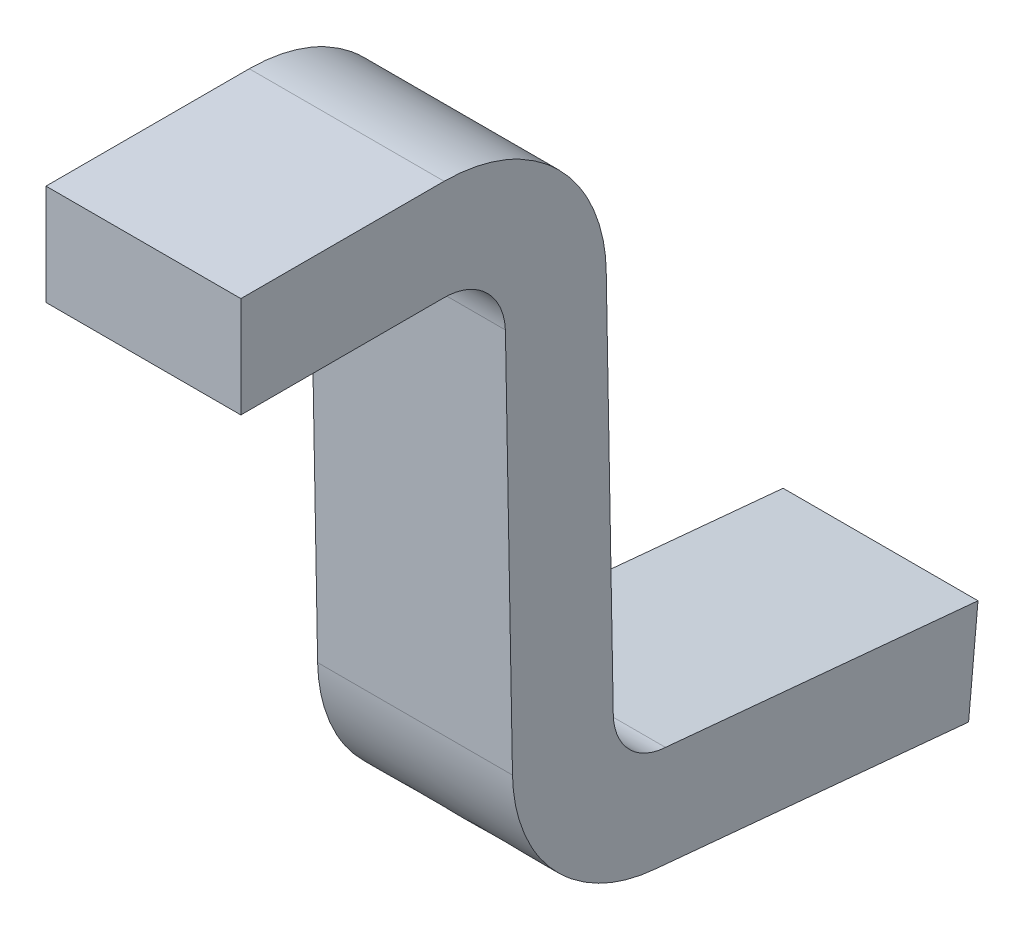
ISO-10303-21;
HEADER;
FILE_DESCRIPTION(('STEP AP214'),'2;1');
FILE_NAME('part.step','',(''),(''),'','','');
FILE_SCHEMA(('AUTOMOTIVE_DESIGN { 1 0 10303 214 1 1 1 1 }'));
ENDSEC;
DATA;
#1=APPLICATION_CONTEXT('core data for automotive mechanical design processes');
#2=APPLICATION_PROTOCOL_DEFINITION('international standard','automotive_design',2000,#1);
#3=PRODUCT_CONTEXT('',#1,'mechanical');
#4=PRODUCT('Part','Part','',(#3));
#5=PRODUCT_RELATED_PRODUCT_CATEGORY('part','',(#4));
#6=PRODUCT_DEFINITION_FORMATION('','',#4);
#7=PRODUCT_DEFINITION_CONTEXT('part definition',#1,'design');
#8=PRODUCT_DEFINITION('design','',#6,#7);
#9=PRODUCT_DEFINITION_SHAPE('','',#8);
#10=(LENGTH_UNIT() NAMED_UNIT(*) SI_UNIT(.MILLI.,.METRE.));
#11=(NAMED_UNIT(*) PLANE_ANGLE_UNIT() SI_UNIT($,.RADIAN.));
#12=(NAMED_UNIT(*) SI_UNIT($,.STERADIAN.) SOLID_ANGLE_UNIT());
#13=UNCERTAINTY_MEASURE_WITH_UNIT(LENGTH_MEASURE(1.E-05),#10,'distance_accuracy_value','');
#14=(GEOMETRIC_REPRESENTATION_CONTEXT(3) GLOBAL_UNCERTAINTY_ASSIGNED_CONTEXT((#13)) GLOBAL_UNIT_ASSIGNED_CONTEXT((#10,
#11,#12)) REPRESENTATION_CONTEXT('',''));
#15=CARTESIAN_POINT('',(0.,0.,0.));
#16=DIRECTION('',(0.,0.,1.));
#17=DIRECTION('',(1.,0.,0.));
#18=AXIS2_PLACEMENT_3D('',#15,#16,#17);
#19=CARTESIAN_POINT('',(2.42146464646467,0.074369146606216,-2.66666666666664));
#20=DIRECTION('',(1.,0.,0.));
#21=DIRECTION('',(0.,0.,-1.));
#22=AXIS2_PLACEMENT_3D('',#19,#20,#21);
#23=PLANE('',#22);
#24=DIRECTION('',(0.,0.,1.));
#25=VECTOR('',#24,1.);
#26=CARTESIAN_POINT('',(2.42146464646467,0.15012672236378,-2.66666666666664));
#27=LINE('',#26,#25);
#28=CARTESIAN_POINT('',(2.42146464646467,0.15012672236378,-2.66666666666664));
#29=VERTEX_POINT('',#28);
#30=CARTESIAN_POINT('',(2.42146464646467,0.15012672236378,-2.9722222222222));
#31=VERTEX_POINT('',#30);
#32=EDGE_CURVE('E110',#29,#31,#27,.F.);
#33=ORIENTED_EDGE('',*,*,#32,.F.);
#34=DIRECTION('',(0.,1.,0.));
#35=VECTOR('',#34,1.);
#36=CARTESIAN_POINT('',(2.42146464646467,0.0743691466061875,-2.66666666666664));
#37=LINE('',#36,#35);
#38=CARTESIAN_POINT('',(2.42146464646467,-0.00138842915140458,-2.66666666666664));
#39=VERTEX_POINT('',#38);
#40=EDGE_CURVE('E144',#39,#29,#37,.T.);
#41=ORIENTED_EDGE('',*,*,#40,.F.);
#42=DIRECTION('',(0.,0.,-1.));
#43=VECTOR('',#42,1.);
#44=CARTESIAN_POINT('',(2.42146464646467,-0.00138842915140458,-2.66666666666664));
#45=LINE('',#44,#43);
#46=CARTESIAN_POINT('',(2.42146464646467,-0.00138842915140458,-2.9722222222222));
#47=VERTEX_POINT('',#46);
#48=EDGE_CURVE('E154',#47,#39,#45,.F.);
#49=ORIENTED_EDGE('',*,*,#48,.F.);
#50=CARTESIAN_POINT('',(2.42146464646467,-0.0895376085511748,-3.06434274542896));
#51=CARTESIAN_POINT('',(2.42146464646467,-0.0843716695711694,-3.06411203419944));
#52=CARTESIAN_POINT('',(2.42146464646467,-0.0792305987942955,-3.06345083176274));
#53=CARTESIAN_POINT('',(2.42146464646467,-0.069139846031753,-3.06128271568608));
#54=CARTESIAN_POINT('',(2.42146464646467,-0.0641898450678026,-3.05977728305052));
#55=CARTESIAN_POINT('',(2.42146464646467,-0.0498351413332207,-3.05402368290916));
#56=CARTESIAN_POINT('',(2.42146464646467,-0.0408983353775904,-3.04853689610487));
#57=CARTESIAN_POINT('',(2.42146464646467,-0.0252463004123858,-3.03492471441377));
#58=CARTESIAN_POINT('',(2.42146464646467,-0.0185472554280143,-3.02678090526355));
#59=CARTESIAN_POINT('',(2.42146464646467,-0.00832190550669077,-3.00876600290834));
#60=CARTESIAN_POINT('',(2.42146464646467,-0.00477139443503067,-2.99890879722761));
#61=CARTESIAN_POINT('',(2.42146464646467,-0.00190306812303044,-2.98330532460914));
#62=CARTESIAN_POINT('',(2.42146464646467,-0.00138892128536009,-2.9777567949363));
#63=CARTESIAN_POINT('',(2.42146464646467,-0.00138842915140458,-2.9722222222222));
#64=B_SPLINE_CURVE_WITH_KNOTS('',3,(#50,#51,#52,#53,#54,#55,#56,#57,#58,#59,#60,#61,#62,#63),
.UNSPECIFIED.,.F.,.F.,(4,2,2,2,2,2,4),(0.,0.0154835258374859,0.0309399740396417,
0.0617747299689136,0.09282789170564,0.123640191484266,0.140260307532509),.UNSPECIFIED.);
#65=CARTESIAN_POINT('',(2.42146464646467,-0.0895376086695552,-3.06434274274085));
#66=VERTEX_POINT('',#65);
#67=EDGE_CURVE('E231',#66,#47,#64,.T.);
#68=ORIENTED_EDGE('',*,*,#67,.F.);
#69=DIRECTION('',(0.,-0.999834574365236,-0.0181885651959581));
#70=VECTOR('',#69,1.);
#71=CARTESIAN_POINT('',(2.42146464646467,-0.0855444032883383,-3.06427009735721));
#72=LINE('',#71,#70);
#73=CARTESIAN_POINT('',(2.42146464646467,-0.674325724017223,-3.07498095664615));
#74=VERTEX_POINT('',#73);
#75=EDGE_CURVE('E159',#74,#66,#72,.F.);
#76=ORIENTED_EDGE('',*,*,#75,.F.);
#77=CARTESIAN_POINT('',(2.42146464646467,-0.904217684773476,-3.29251698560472));
#78=CARTESIAN_POINT('',(2.42146464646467,-0.903253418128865,-3.27923557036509));
#79=CARTESIAN_POINT('',(2.42146464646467,-0.901146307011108,-3.26603489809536));
#80=CARTESIAN_POINT('',(2.42146464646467,-0.894735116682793,-3.24019962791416));
#81=CARTESIAN_POINT('',(2.42146464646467,-0.890434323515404,-3.22756421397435));
#82=CARTESIAN_POINT('',(2.42146464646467,-0.87971183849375,-3.20320102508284));
#83=CARTESIAN_POINT('',(2.42146464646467,-0.873286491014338,-3.19147485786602));
#84=CARTESIAN_POINT('',(2.42146464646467,-0.858565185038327,-3.16926774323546));
#85=CARTESIAN_POINT('',(2.42146464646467,-0.850269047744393,-3.15878691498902));
#86=CARTESIAN_POINT('',(2.42146464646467,-0.832079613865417,-3.1393840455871));
#87=CARTESIAN_POINT('',(2.42146464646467,-0.82219273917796,-3.13045602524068));
#88=CARTESIAN_POINT('',(2.42146464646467,-0.801047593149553,-3.11443411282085));
#89=CARTESIAN_POINT('',(2.42146464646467,-0.789789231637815,-3.10734034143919));
#90=CARTESIAN_POINT('',(2.42146464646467,-0.7547220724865,-3.0892485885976));
#91=CARTESIAN_POINT('',(2.42146464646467,-0.729321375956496,-3.08112640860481));
#92=CARTESIAN_POINT('',(2.42146464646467,-0.693763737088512,-3.07595158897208));
#93=CARTESIAN_POINT('',(2.42146464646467,-0.684036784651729,-3.07515130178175));
#94=CARTESIAN_POINT('',(2.42146464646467,-0.674325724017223,-3.07498095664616));
#95=B_SPLINE_CURVE_WITH_KNOTS('',3,(#77,#78,#79,#80,#81,#82,#83,#84,#85,#86,#87,#88,#89,#90,#91,
#92,#93,#94),.UNSPECIFIED.,.F.,.F.,(4,2,2,2,2,2,2,2,4),(0.,0.039906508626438,0.0797534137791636,
0.119669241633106,0.159588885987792,0.199351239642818,0.239116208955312,0.317406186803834,
0.346598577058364),.UNSPECIFIED.);
#96=CARTESIAN_POINT('',(2.42146464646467,-0.904228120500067,-3.29251615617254));
#97=VERTEX_POINT('',#96);
#98=EDGE_CURVE('E261',#97,#74,#95,.T.);
#99=ORIENTED_EDGE('',*,*,#98,.F.);
#100=DIRECTION('',(0.,-0.0933075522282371,-0.995637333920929));
#101=VECTOR('',#100,1.);
#102=CARTESIAN_POINT('',(2.42146464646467,-0.903788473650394,-3.28771272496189));
#103=LINE('',#102,#101);
#104=CARTESIAN_POINT('',(2.42146464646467,-0.948106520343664,-3.76060801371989));
#105=VERTEX_POINT('',#104);
#106=EDGE_CURVE('E266',#105,#97,#103,.F.);
#107=ORIENTED_EDGE('',*,*,#106,.F.);
#108=DIRECTION('',(0.,-0.995637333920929,0.0933075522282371));
#109=VECTOR('',#108,1.);
#110=CARTESIAN_POINT('',(2.42146464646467,-0.872679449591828,-3.76767676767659));
#111=LINE('',#110,#109);
#112=CARTESIAN_POINT('',(2.42146464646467,-0.79725237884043,-3.77474552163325));
#113=VERTEX_POINT('',#112);
#114=EDGE_CURVE('E272',#105,#113,#111,.F.);
#115=ORIENTED_EDGE('',*,*,#114,.T.);
#116=DIRECTION('',(0.,0.0933075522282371,0.995637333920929));
#117=VECTOR('',#116,1.);
#118=CARTESIAN_POINT('',(2.42146464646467,-0.752934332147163,-3.30185023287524));
#119=LINE('',#118,#117);
#120=CARTESIAN_POINT('',(2.42146464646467,-0.753219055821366,-3.30491431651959));
#121=VERTEX_POINT('',#120);
#122=EDGE_CURVE('E285',#121,#113,#119,.F.);
#123=ORIENTED_EDGE('',*,*,#122,.F.);
#124=CARTESIAN_POINT('',(2.42146464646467,-0.67156988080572,-3.22647104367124));
#125=CARTESIAN_POINT('',(2.42146464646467,-0.680951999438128,-3.22665620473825));
#126=CARTESIAN_POINT('',(2.42146464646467,-0.690284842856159,-3.2284867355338));
#127=CARTESIAN_POINT('',(2.42146464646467,-0.707860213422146,-3.23504258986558));
#128=CARTESIAN_POINT('',(2.42146464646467,-0.716104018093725,-3.23976448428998));
#129=CARTESIAN_POINT('',(2.42146464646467,-0.730659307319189,-3.25181114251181));
#130=CARTESIAN_POINT('',(2.42146464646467,-0.736935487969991,-3.25917886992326));
#131=CARTESIAN_POINT('',(2.42146464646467,-0.746484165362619,-3.2753589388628));
#132=CARTESIAN_POINT('',(2.42146464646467,-0.749840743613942,-3.28412158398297));
#133=CARTESIAN_POINT('',(2.42146464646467,-0.752479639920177,-3.2970411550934));
#134=CARTESIAN_POINT('',(2.42146464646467,-0.752993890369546,-3.30097292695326));
#135=CARTESIAN_POINT('',(2.42146464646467,-0.75321664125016,-3.3049144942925));
#136=B_SPLINE_CURVE_WITH_KNOTS('',3,(#124,#125,#126,#127,#128,#129,#130,#131,#132,#133,#134,
#135),.UNSPECIFIED.,.F.,.F.,(4,2,2,2,2,4),(0.,0.0280129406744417,0.0559927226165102,
0.0844490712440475,0.112055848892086,0.123909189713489),.UNSPECIFIED.);
#137=CARTESIAN_POINT('',(2.42146464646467,-0.67156988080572,-3.22647104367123));
#138=VERTEX_POINT('',#137);
#139=EDGE_CURVE('E126',#138,#121,#136,.T.);
#140=ORIENTED_EDGE('',*,*,#139,.F.);
#141=DIRECTION('',(0.,0.999834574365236,0.0181885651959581));
#142=VECTOR('',#141,1.);
#143=CARTESIAN_POINT('',(2.42146464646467,-0.0827885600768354,-3.21576018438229));
#144=LINE('',#143,#142);
#145=CARTESIAN_POINT('',(2.42146464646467,-0.085222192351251,-3.21580558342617));
#146=VERTEX_POINT('',#145);
#147=EDGE_CURVE('E124',#146,#138,#144,.F.);
#148=ORIENTED_EDGE('',*,*,#147,.F.);
#149=CARTESIAN_POINT('',(2.42146464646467,0.15012672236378,-2.9722222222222));
#150=CARTESIAN_POINT('',(2.42146464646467,0.150121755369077,-2.98592100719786));
#151=CARTESIAN_POINT('',(2.42146464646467,0.148953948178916,-2.99961964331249));
#152=CARTESIAN_POINT('',(2.42146464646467,0.144356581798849,-3.02662157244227));
#153=CARTESIAN_POINT('',(2.42146464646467,0.140928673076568,-3.0399251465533));
#154=CARTESIAN_POINT('',(2.42146464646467,0.131872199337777,-3.06577055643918));
#155=CARTESIAN_POINT('',(2.42146464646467,0.126242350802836,-3.07831194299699));
#156=CARTESIAN_POINT('',(2.42146464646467,0.112966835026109,-3.10227285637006));
#157=CARTESIAN_POINT('',(2.42146464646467,0.10532161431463,-3.11369263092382));
#158=CARTESIAN_POINT('',(2.42146464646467,0.0882177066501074,-3.13509685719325));
#159=CARTESIAN_POINT('',(2.42146464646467,0.0787577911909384,-3.14508032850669));
#160=CARTESIAN_POINT('',(2.42146464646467,0.0582886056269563,-3.16330744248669));
#161=CARTESIAN_POINT('',(2.42146464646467,0.0472792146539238,-3.17155094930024));
#162=CARTESIAN_POINT('',(2.42146464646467,0.0240468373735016,-3.186091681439));
#163=CARTESIAN_POINT('',(2.42146464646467,0.0118240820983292,-3.19238927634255));
#164=CARTESIAN_POINT('',(2.42146464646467,-0.0135063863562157,-3.20282269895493));
#165=CARTESIAN_POINT('',(2.42146464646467,-0.0266133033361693,-3.20696044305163));
#166=CARTESIAN_POINT('',(2.42146464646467,-0.0474003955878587,-3.21164966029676));
#167=CARTESIAN_POINT('',(2.42146464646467,-0.0549141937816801,-3.21297784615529));
#168=CARTESIAN_POINT('',(2.42146464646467,-0.0700207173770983,-3.21492450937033));
#169=CARTESIAN_POINT('',(2.42146464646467,-0.077613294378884,-3.21554413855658));
#170=CARTESIAN_POINT('',(2.42146464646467,-0.0852221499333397,-3.21580671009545));
#171=B_SPLINE_CURVE_WITH_KNOTS('',3,(#149,#150,#151,#152,#153,#154,#155,#156,#157,#158,#159,
#160,#161,#162,#163,#164,#165,#166,#167,#168,#169,#170),.UNSPECIFIED.,.F.,.F.,(4,2,2,2,2,2,2,2,
2,2,4),(0.,0.0410504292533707,0.0820709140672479,0.123115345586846,0.164150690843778,
0.205213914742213,0.246280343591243,0.287338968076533,0.328361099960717,0.351222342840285,
0.374046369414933),.UNSPECIFIED.);
#172=EDGE_CURVE('E24',#31,#146,#171,.T.);
#173=ORIENTED_EDGE('',*,*,#172,.F.);
#174=EDGE_LOOP('',(#33,#41,#49,#68,#76,#99,#107,#115,#123,#140,#148,#173));
#175=FACE_BOUND('',#174,.T.);
#176=ADVANCED_FACE('F17',(#175),#23,.T.);
#177=CARTESIAN_POINT('',(2.27500000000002,0.15012672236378,-2.66666666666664));
#178=DIRECTION('',(0.,1.,0.));
#179=DIRECTION('',(0.,0.,1.));
#180=AXIS2_PLACEMENT_3D('',#177,#178,#179);
#181=PLANE('',#180);
#182=DIRECTION('',(1.,0.,0.));
#183=VECTOR('',#182,1.);
#184=CARTESIAN_POINT('',(2.27500000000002,0.15012672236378,-2.66666666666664));
#185=LINE('',#184,#183);
#186=CARTESIAN_POINT('',(2.12853535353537,0.15012672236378,-2.66666666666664));
#187=VERTEX_POINT('',#186);
#188=EDGE_CURVE('E140',#29,#187,#185,.F.);
#189=ORIENTED_EDGE('',*,*,#188,.F.);
#190=ORIENTED_EDGE('',*,*,#32,.T.);
#191=DIRECTION('',(1.,0.,0.));
#192=VECTOR('',#191,1.);
#193=CARTESIAN_POINT('',(2.27500000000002,0.15012672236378,-2.9722222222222));
#194=LINE('',#193,#192);
#195=CARTESIAN_POINT('',(2.12853535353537,0.15012672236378,-2.9722222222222));
#196=VERTEX_POINT('',#195);
#197=EDGE_CURVE('E121',#196,#31,#194,.T.);
#198=ORIENTED_EDGE('',*,*,#197,.F.);
#199=DIRECTION('',(0.,0.,1.));
#200=VECTOR('',#199,1.);
#201=CARTESIAN_POINT('',(2.12853535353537,0.15012672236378,-2.66666666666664));
#202=LINE('',#201,#200);
#203=EDGE_CURVE('E143',#187,#196,#202,.F.);
#204=ORIENTED_EDGE('',*,*,#203,.F.);
#205=EDGE_LOOP('',(#189,#190,#198,#204));
#206=FACE_BOUND('',#205,.T.);
#207=ADVANCED_FACE('F240',(#206),#181,.T.);
#208=CARTESIAN_POINT('',(2.12853535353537,0.15012672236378,-2.9722222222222));
#209=CARTESIAN_POINT('',(2.12853535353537,0.150125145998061,-3.00374922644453));
#210=CARTESIAN_POINT('',(2.12853535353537,0.13773673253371,-3.06678997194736));
#211=CARTESIAN_POINT('',(2.12853535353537,0.0847512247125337,-3.14729482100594));
#212=CARTESIAN_POINT('',(2.12853535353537,0.0151795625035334,-3.19494083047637));
#213=CARTESIAN_POINT('',(2.12853535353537,-0.0419705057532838,-3.21168889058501));
#214=CARTESIAN_POINT('',(2.12853535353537,-0.0713650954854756,-3.21509896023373));
#215=CARTESIAN_POINT('',(2.12853535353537,-0.0812031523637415,-3.21564002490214));
#216=CARTESIAN_POINT('',(2.12853535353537,-0.0851404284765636,-3.21580841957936));
#217=CARTESIAN_POINT('',(2.12853535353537,-0.086297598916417,-3.21584464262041));
#218=CARTESIAN_POINT('',(2.12853535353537,-0.0876546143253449,-3.21589535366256));
#219=CARTESIAN_POINT('',(2.22617845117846,0.15012672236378,-2.9722222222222));
#220=CARTESIAN_POINT('',(2.22617845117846,0.150125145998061,-3.00374922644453));
#221=CARTESIAN_POINT('',(2.22617845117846,0.13773673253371,-3.06678997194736));
#222=CARTESIAN_POINT('',(2.22617845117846,0.0847512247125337,-3.14729482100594));
#223=CARTESIAN_POINT('',(2.22617845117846,0.0151795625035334,-3.19494083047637));
#224=CARTESIAN_POINT('',(2.22617845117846,-0.0419705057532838,-3.21168889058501));
#225=CARTESIAN_POINT('',(2.22617845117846,-0.0713650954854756,-3.21509896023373));
#226=CARTESIAN_POINT('',(2.22617845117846,-0.0812031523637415,-3.21564002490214));
#227=CARTESIAN_POINT('',(2.22617845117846,-0.0851404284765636,-3.21580841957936));
#228=CARTESIAN_POINT('',(2.22617845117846,-0.086297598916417,-3.21584464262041));
#229=CARTESIAN_POINT('',(2.22617845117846,-0.0876546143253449,-3.21589535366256));
#230=CARTESIAN_POINT('',(2.32382154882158,0.15012672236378,-2.9722222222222));
#231=CARTESIAN_POINT('',(2.32382154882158,0.150125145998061,-3.00374922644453));
#232=CARTESIAN_POINT('',(2.32382154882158,0.13773673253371,-3.06678997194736));
#233=CARTESIAN_POINT('',(2.32382154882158,0.0847512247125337,-3.14729482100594));
#234=CARTESIAN_POINT('',(2.32382154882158,0.0151795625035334,-3.19494083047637));
#235=CARTESIAN_POINT('',(2.32382154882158,-0.0419705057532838,-3.21168889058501));
#236=CARTESIAN_POINT('',(2.32382154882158,-0.0713650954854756,-3.21509896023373));
#237=CARTESIAN_POINT('',(2.32382154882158,-0.0812031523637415,-3.21564002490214));
#238=CARTESIAN_POINT('',(2.32382154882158,-0.0851404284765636,-3.21580841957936));
#239=CARTESIAN_POINT('',(2.32382154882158,-0.086297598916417,-3.21584464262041));
#240=CARTESIAN_POINT('',(2.32382154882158,-0.0876546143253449,-3.21589535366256));
#241=CARTESIAN_POINT('',(2.42146464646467,0.15012672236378,-2.9722222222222));
#242=CARTESIAN_POINT('',(2.42146464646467,0.150125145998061,-3.00374922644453));
#243=CARTESIAN_POINT('',(2.42146464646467,0.13773673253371,-3.06678997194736));
#244=CARTESIAN_POINT('',(2.42146464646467,0.0847512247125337,-3.14729482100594));
#245=CARTESIAN_POINT('',(2.42146464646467,0.0151795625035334,-3.19494083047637));
#246=CARTESIAN_POINT('',(2.42146464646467,-0.0419705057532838,-3.21168889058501));
#247=CARTESIAN_POINT('',(2.42146464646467,-0.0713650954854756,-3.21509896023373));
#248=CARTESIAN_POINT('',(2.42146464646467,-0.0812031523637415,-3.21564002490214));
#249=CARTESIAN_POINT('',(2.42146464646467,-0.0851404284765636,-3.21580841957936));
#250=CARTESIAN_POINT('',(2.42146464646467,-0.086297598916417,-3.21584464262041));
#251=CARTESIAN_POINT('',(2.42146464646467,-0.0876546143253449,-3.21589535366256));
#252=B_SPLINE_SURFACE_WITH_KNOTS('',3,3,((#208,#209,#210,#211,#212,#213,#214,#215,#216,#217,
#218),(#219,#220,#221,#222,#223,#224,#225,#226,#227,#228,#229),(#230,#231,#232,#233,#234,#235,
#236,#237,#238,#239,#240),(#241,#242,#243,#244,#245,#246,#247,#248,#249,#250,#251)),
.UNSPECIFIED.,.F.,.F.,.F.,(4,4),(4,1,1,1,1,1,2,4),(0.,0.292929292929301),(0.,0.388064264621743,
0.776128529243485,1.16419279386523,1.40673295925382,1.50374902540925,1.52800304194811,
1.55225705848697),.UNSPECIFIED.);
#253=DIRECTION('',(1.,0.,0.));
#254=VECTOR('',#253,1.);
#255=CARTESIAN_POINT('',(2.27500000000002,-0.0852222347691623,-3.21580445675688));
#256=LINE('',#255,#254);
#257=CARTESIAN_POINT('',(2.12853535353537,-0.0852222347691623,-3.21580445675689));
#258=VERTEX_POINT('',#257);
#259=EDGE_CURVE('E119',#258,#146,#256,.T.);
#260=CARTESIAN_POINT('',(2.12853535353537,0.15012672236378,-2.9722222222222));
#261=CARTESIAN_POINT('',(2.12853535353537,0.150121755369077,-2.98592100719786));
#262=CARTESIAN_POINT('',(2.12853535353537,0.148953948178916,-2.99961964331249));
#263=CARTESIAN_POINT('',(2.12853535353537,0.144356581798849,-3.02662157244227));
#264=CARTESIAN_POINT('',(2.12853535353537,0.140928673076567,-3.03992514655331));
#265=CARTESIAN_POINT('',(2.12853535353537,0.131872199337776,-3.06577055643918));
#266=CARTESIAN_POINT('',(2.12853535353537,0.126242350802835,-3.07831194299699));
#267=CARTESIAN_POINT('',(2.12853535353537,0.112966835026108,-3.10227285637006));
#268=CARTESIAN_POINT('',(2.12853535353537,0.105321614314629,-3.11369263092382));
#269=CARTESIAN_POINT('',(2.12853535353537,0.0882177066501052,-3.13509685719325));
#270=CARTESIAN_POINT('',(2.12853535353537,0.0787577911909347,-3.1450803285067));
#271=CARTESIAN_POINT('',(2.12853535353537,0.0582886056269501,-3.16330744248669));
#272=CARTESIAN_POINT('',(2.12853535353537,0.0472792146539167,-3.17155094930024));
#273=CARTESIAN_POINT('',(2.12853535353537,0.0240468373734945,-3.18609168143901));
#274=CARTESIAN_POINT('',(2.12853535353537,0.0118240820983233,-3.19238927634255));
#275=CARTESIAN_POINT('',(2.12853535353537,-0.013506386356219,-3.20282269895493));
#276=CARTESIAN_POINT('',(2.12853535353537,-0.026613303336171,-3.20696044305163));
#277=CARTESIAN_POINT('',(2.12853535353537,-0.0474003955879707,-3.21164966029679));
#278=CARTESIAN_POINT('',(2.12853535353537,-0.054914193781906,-3.21297784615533));
#279=CARTESIAN_POINT('',(2.12853535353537,-0.0700207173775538,-3.21492450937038));
#280=CARTESIAN_POINT('',(2.12853535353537,-0.0776132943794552,-3.21554413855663));
#281=CARTESIAN_POINT('',(2.12853535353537,-0.085222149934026,-3.21580671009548));
#282=B_SPLINE_CURVE_WITH_KNOTS('',3,(#260,#261,#262,#263,#264,#265,#266,#267,#268,#269,#270,
#271,#272,#273,#274,#275,#276,#277,#278,#279,#280,#281),.UNSPECIFIED.,.F.,.F.,(4,2,2,2,2,2,2,2,
2,2,4),(0.,0.0410504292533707,0.0820709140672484,0.123115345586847,0.16415069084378,
0.205213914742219,0.246280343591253,0.287338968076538,0.328361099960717,0.351222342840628,
0.374046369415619),.UNSPECIFIED.);
#283=EDGE_CURVE('E226',#196,#258,#282,.T.);
#284=ORIENTED_EDGE('',*,*,#197,.T.);
#285=ORIENTED_EDGE('',*,*,#172,.T.);
#286=ORIENTED_EDGE('',*,*,#259,.F.);
#287=ORIENTED_EDGE('',*,*,#283,.F.);
#288=EDGE_LOOP('',(#284,#285,#286,#287));
#289=FACE_BOUND('',#288,.T.);
#290=ADVANCED_FACE('F116',(#289),#252,.T.);
#291=CARTESIAN_POINT('',(2.27500000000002,-0.0827885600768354,-3.21576018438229));
#292=DIRECTION('',(0.,0.0181885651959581,-0.999834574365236));
#293=DIRECTION('',(0.,0.999834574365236,0.0181885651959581));
#294=AXIS2_PLACEMENT_3D('',#291,#292,#293);
#295=PLANE('',#294);
#296=DIRECTION('',(1.,0.,0.));
#297=VECTOR('',#296,1.);
#298=CARTESIAN_POINT('',(2.27500000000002,-0.67156988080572,-3.22647104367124));
#299=LINE('',#298,#297);
#300=CARTESIAN_POINT('',(2.12853535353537,-0.67156988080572,-3.22647104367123));
#301=VERTEX_POINT('',#300);
#302=EDGE_CURVE('E129',#301,#138,#299,.T.);
#303=ORIENTED_EDGE('',*,*,#302,.F.);
#304=DIRECTION('',(0.,-0.999834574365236,-0.0181885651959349));
#305=VECTOR('',#304,1.);
#306=CARTESIAN_POINT('',(2.12853535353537,-0.0852222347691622,-3.21580445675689));
#307=LINE('',#306,#305);
#308=EDGE_CURVE('E133',#258,#301,#307,.T.);
#309=ORIENTED_EDGE('',*,*,#308,.F.);
#310=ORIENTED_EDGE('',*,*,#259,.T.);
#311=ORIENTED_EDGE('',*,*,#147,.T.);
#312=EDGE_LOOP('',(#303,#309,#310,#311));
#313=FACE_BOUND('',#312,.T.);
#314=ADVANCED_FACE('F131',(#313),#295,.T.);
#315=CARTESIAN_POINT('',(2.12853535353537,-0.67156988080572,-3.22647104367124));
#316=CARTESIAN_POINT('',(2.12853535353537,-0.692510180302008,-3.22685302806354));
#317=CARTESIAN_POINT('',(2.12853535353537,-0.723506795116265,-3.23986463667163));
#318=CARTESIAN_POINT('',(2.12853535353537,-0.74484204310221,-3.27051348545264));
#319=CARTESIAN_POINT('',(2.12853535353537,-0.750749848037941,-3.28794837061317));
#320=CARTESIAN_POINT('',(2.12853535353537,-0.752200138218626,-3.29567617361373));
#321=CARTESIAN_POINT('',(2.12853535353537,-0.752922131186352,-3.30086210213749));
#322=CARTESIAN_POINT('',(2.12853535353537,-0.7530885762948,-3.30299724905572));
#323=CARTESIAN_POINT('',(2.12853535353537,-0.753434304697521,-3.30798410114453));
#324=CARTESIAN_POINT('',(2.22617845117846,-0.67156988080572,-3.22647104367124));
#325=CARTESIAN_POINT('',(2.22617845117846,-0.692510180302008,-3.22685302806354));
#326=CARTESIAN_POINT('',(2.22617845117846,-0.723506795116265,-3.23986463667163));
#327=CARTESIAN_POINT('',(2.22617845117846,-0.74484204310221,-3.27051348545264));
#328=CARTESIAN_POINT('',(2.22617845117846,-0.750749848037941,-3.28794837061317));
#329=CARTESIAN_POINT('',(2.22617845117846,-0.752200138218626,-3.29567617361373));
#330=CARTESIAN_POINT('',(2.22617845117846,-0.752922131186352,-3.30086210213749));
#331=CARTESIAN_POINT('',(2.22617845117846,-0.7530885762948,-3.30299724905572));
#332=CARTESIAN_POINT('',(2.22617845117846,-0.753434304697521,-3.30798410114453));
#333=CARTESIAN_POINT('',(2.32382154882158,-0.67156988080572,-3.22647104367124));
#334=CARTESIAN_POINT('',(2.32382154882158,-0.692510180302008,-3.22685302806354));
#335=CARTESIAN_POINT('',(2.32382154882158,-0.723506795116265,-3.23986463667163));
#336=CARTESIAN_POINT('',(2.32382154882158,-0.74484204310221,-3.27051348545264));
#337=CARTESIAN_POINT('',(2.32382154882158,-0.750749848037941,-3.28794837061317));
#338=CARTESIAN_POINT('',(2.32382154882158,-0.752200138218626,-3.29567617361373));
#339=CARTESIAN_POINT('',(2.32382154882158,-0.752922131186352,-3.30086210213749));
#340=CARTESIAN_POINT('',(2.32382154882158,-0.7530885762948,-3.30299724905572));
#341=CARTESIAN_POINT('',(2.32382154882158,-0.753434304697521,-3.30798410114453));
#342=CARTESIAN_POINT('',(2.42146464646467,-0.67156988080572,-3.22647104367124));
#343=CARTESIAN_POINT('',(2.42146464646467,-0.692510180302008,-3.22685302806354));
#344=CARTESIAN_POINT('',(2.42146464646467,-0.723506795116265,-3.23986463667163));
#345=CARTESIAN_POINT('',(2.42146464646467,-0.74484204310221,-3.27051348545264));
#346=CARTESIAN_POINT('',(2.42146464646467,-0.750749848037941,-3.28794837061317));
#347=CARTESIAN_POINT('',(2.42146464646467,-0.752200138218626,-3.29567617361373));
#348=CARTESIAN_POINT('',(2.42146464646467,-0.752922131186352,-3.30086210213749));
#349=CARTESIAN_POINT('',(2.42146464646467,-0.7530885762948,-3.30299724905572));
#350=CARTESIAN_POINT('',(2.42146464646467,-0.753434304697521,-3.30798410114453));
#351=B_SPLINE_SURFACE_WITH_KNOTS('',3,3,((#315,#316,#317,#318,#319,#320,#321,#322,#323),(#324,
#325,#326,#327,#328,#329,#330,#331,#332),(#333,#334,#335,#336,#337,#338,#339,#340,#341),(#342,
#343,#344,#345,#346,#347,#348,#349,#350)),.UNSPECIFIED.,.F.,.F.,.F.,(4,4),(4,1,1,1,2,4),(0.,
0.292929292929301),(0.,0.754253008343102,1.13137951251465,1.31994276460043,1.41422439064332,
1.5085060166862),.UNSPECIFIED.);
#352=DIRECTION('',(1.,0.,0.));
#353=VECTOR('',#352,1.);
#354=CARTESIAN_POINT('',(2.27500000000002,-0.753221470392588,-3.3049141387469));
#355=LINE('',#354,#353);
#356=CARTESIAN_POINT('',(2.12853535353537,-0.753220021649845,-3.30491424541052));
#357=VERTEX_POINT('',#356);
#358=EDGE_CURVE('E287',#357,#121,#355,.T.);
#359=CARTESIAN_POINT('',(2.12853535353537,-0.67156988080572,-3.22647104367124));
#360=CARTESIAN_POINT('',(2.12853535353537,-0.680951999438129,-3.22665620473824));
#361=CARTESIAN_POINT('',(2.12853535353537,-0.69028484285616,-3.2284867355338));
#362=CARTESIAN_POINT('',(2.12853535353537,-0.707860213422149,-3.23504258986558));
#363=CARTESIAN_POINT('',(2.12853535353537,-0.716104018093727,-3.23976448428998));
#364=CARTESIAN_POINT('',(2.12853535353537,-0.730659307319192,-3.25181114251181));
#365=CARTESIAN_POINT('',(2.12853535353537,-0.736935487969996,-3.25917886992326));
#366=CARTESIAN_POINT('',(2.12853535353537,-0.746484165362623,-3.27535893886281));
#367=CARTESIAN_POINT('',(2.12853535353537,-0.749840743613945,-3.28412158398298));
#368=CARTESIAN_POINT('',(2.12853535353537,-0.752479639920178,-3.2970411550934));
#369=CARTESIAN_POINT('',(2.12853535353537,-0.752993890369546,-3.30097292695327));
#370=CARTESIAN_POINT('',(2.12853535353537,-0.753216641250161,-3.30491449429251));
#371=B_SPLINE_CURVE_WITH_KNOTS('',3,(#359,#360,#361,#362,#363,#364,#365,#366,#367,#368,#369,
#370),.UNSPECIFIED.,.F.,.F.,(4,2,2,2,2,4),(0.,0.0280129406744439,0.055992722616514,
0.0844490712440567,0.112055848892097,0.123909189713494),.UNSPECIFIED.);
#372=EDGE_CURVE('E207',#301,#357,#371,.T.);
#373=ORIENTED_EDGE('',*,*,#302,.T.);
#374=ORIENTED_EDGE('',*,*,#139,.T.);
#375=ORIENTED_EDGE('',*,*,#358,.F.);
#376=ORIENTED_EDGE('',*,*,#372,.F.);
#377=EDGE_LOOP('',(#373,#374,#375,#376));
#378=FACE_BOUND('',#377,.T.);
#379=ADVANCED_FACE('F185',(#378),#351,.T.);
#380=CARTESIAN_POINT('',(2.27500000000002,-0.752934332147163,-3.30185023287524));
#381=DIRECTION('',(0.,0.995637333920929,-0.0933075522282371));
#382=DIRECTION('',(0.,0.0933075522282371,0.995637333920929));
#383=AXIS2_PLACEMENT_3D('',#380,#381,#382);
#384=PLANE('',#383);
#385=DIRECTION('',(1.,0.,0.));
#386=VECTOR('',#385,1.);
#387=CARTESIAN_POINT('',(2.27499999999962,-0.797252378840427,-3.77474552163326));
#388=LINE('',#387,#386);
#389=CARTESIAN_POINT('',(2.12853535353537,-0.797252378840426,-3.77474552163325));
#390=VERTEX_POINT('',#389);
#391=EDGE_CURVE('E282',#113,#390,#388,.F.);
#392=ORIENTED_EDGE('',*,*,#391,.T.);
#393=DIRECTION('',(0.,-0.0933075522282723,-0.995637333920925));
#394=VECTOR('',#393,1.);
#395=CARTESIAN_POINT('',(2.12853535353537,-0.75322147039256,-3.3049141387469));
#396=LINE('',#395,#394);
#397=EDGE_CURVE('E302',#357,#390,#396,.T.);
#398=ORIENTED_EDGE('',*,*,#397,.F.);
#399=ORIENTED_EDGE('',*,*,#358,.T.);
#400=ORIENTED_EDGE('',*,*,#122,.T.);
#401=EDGE_LOOP('',(#392,#398,#399,#400));
#402=FACE_BOUND('',#401,.T.);
#403=ADVANCED_FACE('F357',(#402),#384,.T.);
#404=CARTESIAN_POINT('',(2.27499999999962,-0.872679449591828,-3.76767676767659));
#405=DIRECTION('',(0.,0.0933075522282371,0.995637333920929));
#406=DIRECTION('',(0.,-0.995637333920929,0.0933075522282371));
#407=AXIS2_PLACEMENT_3D('',#404,#405,#406);
#408=PLANE('',#407);
#409=DIRECTION('',(1.,0.,0.));
#410=VECTOR('',#409,1.);
#411=CARTESIAN_POINT('',(2.27500000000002,-0.948106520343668,-3.76060801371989));
#412=LINE('',#411,#410);
#413=CARTESIAN_POINT('',(2.12853535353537,-0.948106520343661,-3.76060801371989));
#414=VERTEX_POINT('',#413);
#415=EDGE_CURVE('E267',#414,#105,#412,.T.);
#416=ORIENTED_EDGE('',*,*,#415,.F.);
#417=DIRECTION('',(0.,-0.995637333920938,0.0933075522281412));
#418=VECTOR('',#417,1.);
#419=CARTESIAN_POINT('',(2.12853535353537,-0.797252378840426,-3.77474552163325));
#420=LINE('',#419,#418);
#421=EDGE_CURVE('E298',#390,#414,#420,.T.);
#422=ORIENTED_EDGE('',*,*,#421,.F.);
#423=ORIENTED_EDGE('',*,*,#391,.F.);
#424=ORIENTED_EDGE('',*,*,#114,.F.);
#425=EDGE_LOOP('',(#416,#422,#423,#424));
#426=FACE_BOUND('',#425,.T.);
#427=ADVANCED_FACE('F354',(#426),#408,.F.);
#428=CARTESIAN_POINT('',(2.27500000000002,-0.903788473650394,-3.28771272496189));
#429=DIRECTION('',(0.,-0.995637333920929,0.0933075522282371));
#430=DIRECTION('',(0.,-0.0933075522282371,-0.995637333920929));
#431=AXIS2_PLACEMENT_3D('',#428,#429,#430);
#432=PLANE('',#431);
#433=ORIENTED_EDGE('',*,*,#415,.T.);
#434=ORIENTED_EDGE('',*,*,#106,.T.);
#435=CARTESIAN_POINT('',(2.12853535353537,-0.904217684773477,-3.29251698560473));
#436=CARTESIAN_POINT('',(2.22617845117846,-0.904217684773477,-3.29251698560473));
#437=CARTESIAN_POINT('',(2.32382154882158,-0.904217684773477,-3.29251698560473));
#438=CARTESIAN_POINT('',(2.42146464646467,-0.904217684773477,-3.29251698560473));
#439=B_SPLINE_CURVE_WITH_KNOTS('',3,(#435,#436,#437,#438),.UNSPECIFIED.,.F.,.F.,(4,4),(0.,
0.292929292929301),.UNSPECIFIED.);
#440=CARTESIAN_POINT('',(2.12853535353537,-0.904228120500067,-3.29251615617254));
#441=VERTEX_POINT('',#440);
#442=EDGE_CURVE('E167',#441,#97,#439,.T.);
#443=ORIENTED_EDGE('',*,*,#442,.F.);
#444=DIRECTION('',(0.,0.0933075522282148,0.995637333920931));
#445=VECTOR('',#444,1.);
#446=CARTESIAN_POINT('',(2.12853535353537,-0.948106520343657,-3.76060801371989));
#447=LINE('',#446,#445);
#448=EDGE_CURVE('E301',#414,#441,#447,.T.);
#449=ORIENTED_EDGE('',*,*,#448,.F.);
#450=EDGE_LOOP('',(#433,#434,#443,#449));
#451=FACE_BOUND('',#450,.T.);
#452=ADVANCED_FACE('F184',(#451),#432,.T.);
#453=CARTESIAN_POINT('',(2.42146464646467,-0.674325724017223,-3.07498095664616));
#454=CARTESIAN_POINT('',(2.42146464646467,-0.7185963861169,-3.07578852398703));
#455=CARTESIAN_POINT('',(2.42146464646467,-0.806582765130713,-3.10312483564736));
#456=CARTESIAN_POINT('',(2.42146464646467,-0.876135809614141,-3.1850666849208));
#457=CARTESIAN_POINT('',(2.42146464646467,-0.897522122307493,-3.24827627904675));
#458=CARTESIAN_POINT('',(2.42146464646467,-0.90161027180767,-3.27005979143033));
#459=CARTESIAN_POINT('',(2.42146464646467,-0.903645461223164,-3.28467814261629));
#460=CARTESIAN_POINT('',(2.42146464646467,-0.904240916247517,-3.29251816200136));
#461=CARTESIAN_POINT('',(2.42146464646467,-0.904586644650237,-3.29750501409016));
#462=CARTESIAN_POINT('',(2.32382154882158,-0.674325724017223,-3.07498095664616));
#463=CARTESIAN_POINT('',(2.32382154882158,-0.7185963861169,-3.07578852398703));
#464=CARTESIAN_POINT('',(2.32382154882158,-0.806582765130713,-3.10312483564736));
#465=CARTESIAN_POINT('',(2.32382154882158,-0.876135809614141,-3.1850666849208));
#466=CARTESIAN_POINT('',(2.32382154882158,-0.897522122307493,-3.24827627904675));
#467=CARTESIAN_POINT('',(2.32382154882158,-0.90161027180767,-3.27005979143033));
#468=CARTESIAN_POINT('',(2.32382154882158,-0.903645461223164,-3.28467814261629));
#469=CARTESIAN_POINT('',(2.32382154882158,-0.904240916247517,-3.29251816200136));
#470=CARTESIAN_POINT('',(2.32382154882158,-0.904586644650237,-3.29750501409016));
#471=CARTESIAN_POINT('',(2.22617845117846,-0.674325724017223,-3.07498095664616));
#472=CARTESIAN_POINT('',(2.22617845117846,-0.7185963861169,-3.07578852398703));
#473=CARTESIAN_POINT('',(2.22617845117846,-0.806582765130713,-3.10312483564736));
#474=CARTESIAN_POINT('',(2.22617845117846,-0.876135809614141,-3.1850666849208));
#475=CARTESIAN_POINT('',(2.22617845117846,-0.897522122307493,-3.24827627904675));
#476=CARTESIAN_POINT('',(2.22617845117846,-0.90161027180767,-3.27005979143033));
#477=CARTESIAN_POINT('',(2.22617845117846,-0.903645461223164,-3.28467814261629));
#478=CARTESIAN_POINT('',(2.22617845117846,-0.904240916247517,-3.29251816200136));
#479=CARTESIAN_POINT('',(2.22617845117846,-0.904586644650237,-3.29750501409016));
#480=CARTESIAN_POINT('',(2.12853535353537,-0.674325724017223,-3.07498095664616));
#481=CARTESIAN_POINT('',(2.12853535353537,-0.7185963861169,-3.07578852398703));
#482=CARTESIAN_POINT('',(2.12853535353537,-0.806582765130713,-3.10312483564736));
#483=CARTESIAN_POINT('',(2.12853535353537,-0.876135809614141,-3.1850666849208));
#484=CARTESIAN_POINT('',(2.12853535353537,-0.897522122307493,-3.24827627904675));
#485=CARTESIAN_POINT('',(2.12853535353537,-0.90161027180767,-3.27005979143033));
#486=CARTESIAN_POINT('',(2.12853535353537,-0.903645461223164,-3.28467814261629));
#487=CARTESIAN_POINT('',(2.12853535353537,-0.904240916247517,-3.29251816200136));
#488=CARTESIAN_POINT('',(2.12853535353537,-0.904586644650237,-3.29750501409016));
#489=B_SPLINE_SURFACE_WITH_KNOTS('',3,3,((#453,#454,#455,#456,#457,#458,#459,#460,#461),(#462,
#463,#464,#465,#466,#467,#468,#469,#470),(#471,#472,#473,#474,#475,#476,#477,#478,#479),(#480,
#481,#482,#483,#484,#485,#486,#487,#488)),.UNSPECIFIED.,.F.,.F.,.F.,(4,4),(4,1,1,1,2,4),(0.,
0.292929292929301),(0.,0.565689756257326,1.13137951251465,1.31994276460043,1.41422439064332,
1.5085060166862),.UNSPECIFIED.);
#490=DIRECTION('',(1.,0.,0.));
#491=VECTOR('',#490,1.);
#492=CARTESIAN_POINT('',(2.27500000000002,-0.674325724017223,-3.07498095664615));
#493=LINE('',#492,#491);
#494=CARTESIAN_POINT('',(2.12853535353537,-0.674325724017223,-3.07498095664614));
#495=VERTEX_POINT('',#494);
#496=EDGE_CURVE('E162',#495,#74,#493,.T.);
#497=CARTESIAN_POINT('',(2.12853535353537,-0.904217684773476,-3.29251698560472));
#498=CARTESIAN_POINT('',(2.12853535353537,-0.903253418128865,-3.27923557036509));
#499=CARTESIAN_POINT('',(2.12853535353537,-0.901146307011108,-3.26603489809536));
#500=CARTESIAN_POINT('',(2.12853535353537,-0.894735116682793,-3.24019962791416));
#501=CARTESIAN_POINT('',(2.12853535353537,-0.890434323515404,-3.22756421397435));
#502=CARTESIAN_POINT('',(2.12853535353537,-0.879711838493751,-3.20320102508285));
#503=CARTESIAN_POINT('',(2.12853535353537,-0.873286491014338,-3.19147485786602));
#504=CARTESIAN_POINT('',(2.12853535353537,-0.858565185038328,-3.16926774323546));
#505=CARTESIAN_POINT('',(2.12853535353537,-0.850269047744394,-3.15878691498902));
#506=CARTESIAN_POINT('',(2.12853535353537,-0.832079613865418,-3.1393840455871));
#507=CARTESIAN_POINT('',(2.12853535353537,-0.82219273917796,-3.13045602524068));
#508=CARTESIAN_POINT('',(2.12853535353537,-0.801047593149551,-3.11443411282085));
#509=CARTESIAN_POINT('',(2.12853535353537,-0.789789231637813,-3.10734034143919));
#510=CARTESIAN_POINT('',(2.12853535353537,-0.754722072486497,-3.0892485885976));
#511=CARTESIAN_POINT('',(2.12853535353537,-0.729321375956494,-3.08112640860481));
#512=CARTESIAN_POINT('',(2.12853535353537,-0.69376373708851,-3.07595158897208));
#513=CARTESIAN_POINT('',(2.12853535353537,-0.684036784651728,-3.07515130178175));
#514=CARTESIAN_POINT('',(2.12853535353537,-0.674325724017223,-3.07498095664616));
#515=B_SPLINE_CURVE_WITH_KNOTS('',3,(#497,#498,#499,#500,#501,#502,#503,#504,#505,#506,#507,
#508,#509,#510,#511,#512,#513,#514),.UNSPECIFIED.,.F.,.F.,(4,2,2,2,2,2,2,2,4),(0.,
0.0399065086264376,0.0797534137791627,0.119669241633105,0.159588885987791,0.199351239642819,
0.239116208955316,0.317406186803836,0.346598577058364),.UNSPECIFIED.);
#516=EDGE_CURVE('E205',#441,#495,#515,.T.);
#517=ORIENTED_EDGE('',*,*,#496,.F.);
#518=ORIENTED_EDGE('',*,*,#516,.F.);
#519=ORIENTED_EDGE('',*,*,#442,.T.);
#520=ORIENTED_EDGE('',*,*,#98,.T.);
#521=EDGE_LOOP('',(#517,#518,#519,#520));
#522=FACE_BOUND('',#521,.T.);
#523=ADVANCED_FACE('F172',(#522),#489,.T.);
#524=CARTESIAN_POINT('',(2.27500000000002,-0.0855444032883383,-3.06427009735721));
#525=DIRECTION('',(0.,-0.0181885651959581,0.999834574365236));
#526=DIRECTION('',(0.,-0.999834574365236,-0.0181885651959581));
#527=AXIS2_PLACEMENT_3D('',#524,#525,#526);
#528=PLANE('',#527);
#529=ORIENTED_EDGE('',*,*,#496,.T.);
#530=ORIENTED_EDGE('',*,*,#75,.T.);
#531=DIRECTION('',(1.,0.,0.));
#532=VECTOR('',#531,1.);
#533=CARTESIAN_POINT('',(2.27500000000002,-0.0895376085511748,-3.06434274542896));
#534=LINE('',#533,#532);
#535=CARTESIAN_POINT('',(2.12853535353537,-0.0895376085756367,-3.06434274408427));
#536=VERTEX_POINT('',#535);
#537=EDGE_CURVE('E161',#536,#66,#534,.T.);
#538=ORIENTED_EDGE('',*,*,#537,.F.);
#539=DIRECTION('',(0.,0.999834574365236,0.0181885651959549));
#540=VECTOR('',#539,1.);
#541=CARTESIAN_POINT('',(2.12853535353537,-0.674325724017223,-3.07498095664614));
#542=LINE('',#541,#540);
#543=EDGE_CURVE('E327',#495,#536,#542,.T.);
#544=ORIENTED_EDGE('',*,*,#543,.F.);
#545=EDGE_LOOP('',(#529,#530,#538,#544));
#546=FACE_BOUND('',#545,.T.);
#547=ADVANCED_FACE('F183',(#546),#528,.T.);
#548=CARTESIAN_POINT('',(2.42146464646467,-0.00138842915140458,-2.9722222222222));
#549=CARTESIAN_POINT('',(2.42146464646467,-0.0013893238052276,-2.99011392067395));
#550=CARTESIAN_POINT('',(2.42146464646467,-0.0121055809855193,-3.02585767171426));
#551=CARTESIAN_POINT('',(2.42146464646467,-0.0466662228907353,-3.05480854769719));
#552=CARTESIAN_POINT('',(2.42146464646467,-0.0740657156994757,-3.06282107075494));
#553=CARTESIAN_POINT('',(2.42146464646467,-0.0851867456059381,-3.06411122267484));
#554=CARTESIAN_POINT('',(2.42146464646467,-0.0889088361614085,-3.06431592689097));
#555=CARTESIAN_POINT('',(2.42146464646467,-0.090398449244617,-3.06437963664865));
#556=CARTESIAN_POINT('',(2.42146464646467,-0.0919557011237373,-3.06443517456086));
#557=CARTESIAN_POINT('',(2.42146464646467,-0.0933127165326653,-3.06448588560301));
#558=CARTESIAN_POINT('',(2.32382154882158,-0.00138842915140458,-2.9722222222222));
#559=CARTESIAN_POINT('',(2.32382154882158,-0.0013893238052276,-2.99011392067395));
#560=CARTESIAN_POINT('',(2.32382154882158,-0.0121055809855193,-3.02585767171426));
#561=CARTESIAN_POINT('',(2.32382154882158,-0.0466662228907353,-3.05480854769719));
#562=CARTESIAN_POINT('',(2.32382154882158,-0.0740657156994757,-3.06282107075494));
#563=CARTESIAN_POINT('',(2.32382154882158,-0.0851867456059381,-3.06411122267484));
#564=CARTESIAN_POINT('',(2.32382154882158,-0.0889088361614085,-3.06431592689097));
#565=CARTESIAN_POINT('',(2.32382154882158,-0.090398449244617,-3.06437963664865));
#566=CARTESIAN_POINT('',(2.32382154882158,-0.0919557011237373,-3.06443517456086));
#567=CARTESIAN_POINT('',(2.32382154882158,-0.0933127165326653,-3.06448588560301));
#568=CARTESIAN_POINT('',(2.22617845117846,-0.00138842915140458,-2.9722222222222));
#569=CARTESIAN_POINT('',(2.22617845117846,-0.0013893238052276,-2.99011392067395));
#570=CARTESIAN_POINT('',(2.22617845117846,-0.0121055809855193,-3.02585767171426));
#571=CARTESIAN_POINT('',(2.22617845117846,-0.0466662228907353,-3.05480854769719));
#572=CARTESIAN_POINT('',(2.22617845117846,-0.0740657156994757,-3.06282107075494));
#573=CARTESIAN_POINT('',(2.22617845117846,-0.0851867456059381,-3.06411122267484));
#574=CARTESIAN_POINT('',(2.22617845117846,-0.0889088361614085,-3.06431592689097));
#575=CARTESIAN_POINT('',(2.22617845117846,-0.090398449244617,-3.06437963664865));
#576=CARTESIAN_POINT('',(2.22617845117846,-0.0919557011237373,-3.06443517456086));
#577=CARTESIAN_POINT('',(2.22617845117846,-0.0933127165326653,-3.06448588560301));
#578=CARTESIAN_POINT('',(2.12853535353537,-0.00138842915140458,-2.9722222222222));
#579=CARTESIAN_POINT('',(2.12853535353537,-0.0013893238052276,-2.99011392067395));
#580=CARTESIAN_POINT('',(2.12853535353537,-0.0121055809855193,-3.02585767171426));
#581=CARTESIAN_POINT('',(2.12853535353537,-0.0466662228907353,-3.05480854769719));
#582=CARTESIAN_POINT('',(2.12853535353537,-0.0740657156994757,-3.06282107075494));
#583=CARTESIAN_POINT('',(2.12853535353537,-0.0851867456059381,-3.06411122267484));
#584=CARTESIAN_POINT('',(2.12853535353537,-0.0889088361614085,-3.06431592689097));
#585=CARTESIAN_POINT('',(2.12853535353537,-0.090398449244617,-3.06437963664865));
#586=CARTESIAN_POINT('',(2.12853535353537,-0.0919557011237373,-3.06443517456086));
#587=CARTESIAN_POINT('',(2.12853535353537,-0.0933127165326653,-3.06448588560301));
#588=B_SPLINE_SURFACE_WITH_KNOTS('',3,3,((#548,#549,#550,#551,#552,#553,#554,#555,#556,#557),
(#558,#559,#560,#561,#562,#563,#564,#565,#566,#567),(#568,#569,#570,#571,#572,#573,#574,#575,
#576,#577),(#578,#579,#580,#581,#582,#583,#584,#585,#586,#587)),.UNSPECIFIED.,.F.,.F.,.F.,(4,4),
(4,1,1,1,1,2,4),(0.,0.292929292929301),(0.,0.582096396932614,1.16419279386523,1.40673295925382,
1.50374902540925,1.52800304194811,1.55225705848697),.UNSPECIFIED.);
#589=DIRECTION('',(1.,0.,0.));
#590=VECTOR('',#589,1.);
#591=CARTESIAN_POINT('',(2.27500000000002,-0.00138842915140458,-2.9722222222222));
#592=LINE('',#591,#590);
#593=CARTESIAN_POINT('',(2.12853535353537,-0.00138842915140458,-2.9722222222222));
#594=VERTEX_POINT('',#593);
#595=EDGE_CURVE('E156',#594,#47,#592,.T.);
#596=CARTESIAN_POINT('',(2.12853535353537,-0.0895376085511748,-3.06434274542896));
#597=CARTESIAN_POINT('',(2.12853535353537,-0.0843716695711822,-3.06411203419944));
#598=CARTESIAN_POINT('',(2.12853535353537,-0.0792305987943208,-3.06345083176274));
#599=CARTESIAN_POINT('',(2.12853535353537,-0.0691398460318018,-3.06128271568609));
#600=CARTESIAN_POINT('',(2.12853535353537,-0.0641898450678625,-3.05977728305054));
#601=CARTESIAN_POINT('',(2.12853535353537,-0.0498351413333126,-3.05402368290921));
#602=CARTESIAN_POINT('',(2.12853535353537,-0.0408983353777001,-3.04853689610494));
#603=CARTESIAN_POINT('',(2.12853535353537,-0.0252463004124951,-3.03492471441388));
#604=CARTESIAN_POINT('',(2.12853535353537,-0.0185472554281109,-3.02678090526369));
#605=CARTESIAN_POINT('',(2.12853535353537,-0.00832190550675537,-3.00876600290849));
#606=CARTESIAN_POINT('',(2.12853535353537,-0.00477139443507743,-2.99890879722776));
#607=CARTESIAN_POINT('',(2.12853535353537,-0.00190306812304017,-2.98330532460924));
#608=CARTESIAN_POINT('',(2.12853535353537,-0.00138892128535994,-2.97775679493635));
#609=CARTESIAN_POINT('',(2.12853535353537,-0.00138842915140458,-2.9722222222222));
#610=B_SPLINE_CURVE_WITH_KNOTS('',3,(#596,#597,#598,#599,#600,#601,#602,#603,#604,#605,#606,
#607,#608,#609),.UNSPECIFIED.,.F.,.F.,(4,2,2,2,2,2,4),(0.,0.0154835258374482,0.0309399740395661,
0.0617747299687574,0.0928278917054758,0.123640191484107,0.14026030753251),.UNSPECIFIED.);
#611=EDGE_CURVE('E221',#536,#594,#610,.T.);
#612=ORIENTED_EDGE('',*,*,#595,.F.);
#613=ORIENTED_EDGE('',*,*,#611,.F.);
#614=ORIENTED_EDGE('',*,*,#537,.T.);
#615=ORIENTED_EDGE('',*,*,#67,.T.);
#616=EDGE_LOOP('',(#612,#613,#614,#615));
#617=FACE_BOUND('',#616,.T.);
#618=ADVANCED_FACE('F19',(#617),#588,.T.);
#619=CARTESIAN_POINT('',(2.27500000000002,-0.00138842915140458,-2.66666666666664));
#620=DIRECTION('',(0.,-1.,0.));
#621=DIRECTION('',(0.,0.,-1.));
#622=AXIS2_PLACEMENT_3D('',#619,#620,#621);
#623=PLANE('',#622);
#624=DIRECTION('',(1.,0.,0.));
#625=VECTOR('',#624,1.);
#626=CARTESIAN_POINT('',(2.27500000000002,-0.00138842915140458,-2.66666666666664));
#627=LINE('',#626,#625);
#628=CARTESIAN_POINT('',(2.12853535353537,-0.00138842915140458,-2.66666666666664));
#629=VERTEX_POINT('',#628);
#630=EDGE_CURVE('E44',#629,#39,#627,.T.);
#631=ORIENTED_EDGE('',*,*,#630,.F.);
#632=DIRECTION('',(0.,0.,1.));
#633=VECTOR('',#632,1.);
#634=CARTESIAN_POINT('',(2.12853535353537,-0.00138842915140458,-2.66666666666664));
#635=LINE('',#634,#633);
#636=EDGE_CURVE('E35',#594,#629,#635,.T.);
#637=ORIENTED_EDGE('',*,*,#636,.F.);
#638=ORIENTED_EDGE('',*,*,#595,.T.);
#639=ORIENTED_EDGE('',*,*,#48,.T.);
#640=EDGE_LOOP('',(#631,#637,#638,#639));
#641=FACE_BOUND('',#640,.T.);
#642=ADVANCED_FACE('F340',(#641),#623,.T.);
#643=CARTESIAN_POINT('',(2.27500000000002,0.0743691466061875,-2.66666666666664));
#644=DIRECTION('',(0.,0.,1.));
#645=DIRECTION('',(1.,0.,0.));
#646=AXIS2_PLACEMENT_3D('',#643,#644,#645);
#647=PLANE('',#646);
#648=ORIENTED_EDGE('',*,*,#188,.T.);
#649=DIRECTION('',(0.,1.,0.));
#650=VECTOR('',#649,1.);
#651=CARTESIAN_POINT('',(2.12853535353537,0.0743691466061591,-2.66666666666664));
#652=LINE('',#651,#650);
#653=EDGE_CURVE('E11',#629,#187,#652,.T.);
#654=ORIENTED_EDGE('',*,*,#653,.F.);
#655=ORIENTED_EDGE('',*,*,#630,.T.);
#656=ORIENTED_EDGE('',*,*,#40,.T.);
#657=EDGE_LOOP('',(#648,#654,#655,#656));
#658=FACE_BOUND('',#657,.T.);
#659=ADVANCED_FACE('F216',(#658),#647,.T.);
#660=CARTESIAN_POINT('',(2.12853535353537,0.0743691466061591,-2.66666666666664));
#661=DIRECTION('',(-1.,0.,0.));
#662=DIRECTION('',(0.,0.,1.));
#663=AXIS2_PLACEMENT_3D('',#660,#661,#662);
#664=PLANE('',#663);
#665=ORIENTED_EDGE('',*,*,#636,.T.);
#666=ORIENTED_EDGE('',*,*,#653,.T.);
#667=ORIENTED_EDGE('',*,*,#203,.T.);
#668=ORIENTED_EDGE('',*,*,#283,.T.);
#669=ORIENTED_EDGE('',*,*,#308,.T.);
#670=ORIENTED_EDGE('',*,*,#372,.T.);
#671=ORIENTED_EDGE('',*,*,#397,.T.);
#672=ORIENTED_EDGE('',*,*,#421,.T.);
#673=ORIENTED_EDGE('',*,*,#448,.T.);
#674=ORIENTED_EDGE('',*,*,#516,.T.);
#675=ORIENTED_EDGE('',*,*,#543,.T.);
#676=ORIENTED_EDGE('',*,*,#611,.T.);
#677=EDGE_LOOP('',(#665,#666,#667,#668,#669,#670,#671,#672,#673,#674,#675,#676));
#678=FACE_BOUND('',#677,.T.);
#679=ADVANCED_FACE('F212',(#678),#664,.T.);
#680=CLOSED_SHELL('',(#176,#207,#290,#314,#379,#403,#427,#452,#523,#547,#618,#642,#659,#679));
#681=MANIFOLD_SOLID_BREP('B1',#680);
#682=ADVANCED_BREP_SHAPE_REPRESENTATION('',(#18,#681),#14);
#683=SHAPE_DEFINITION_REPRESENTATION(#9,#682);
ENDSEC;
END-ISO-10303-21;
